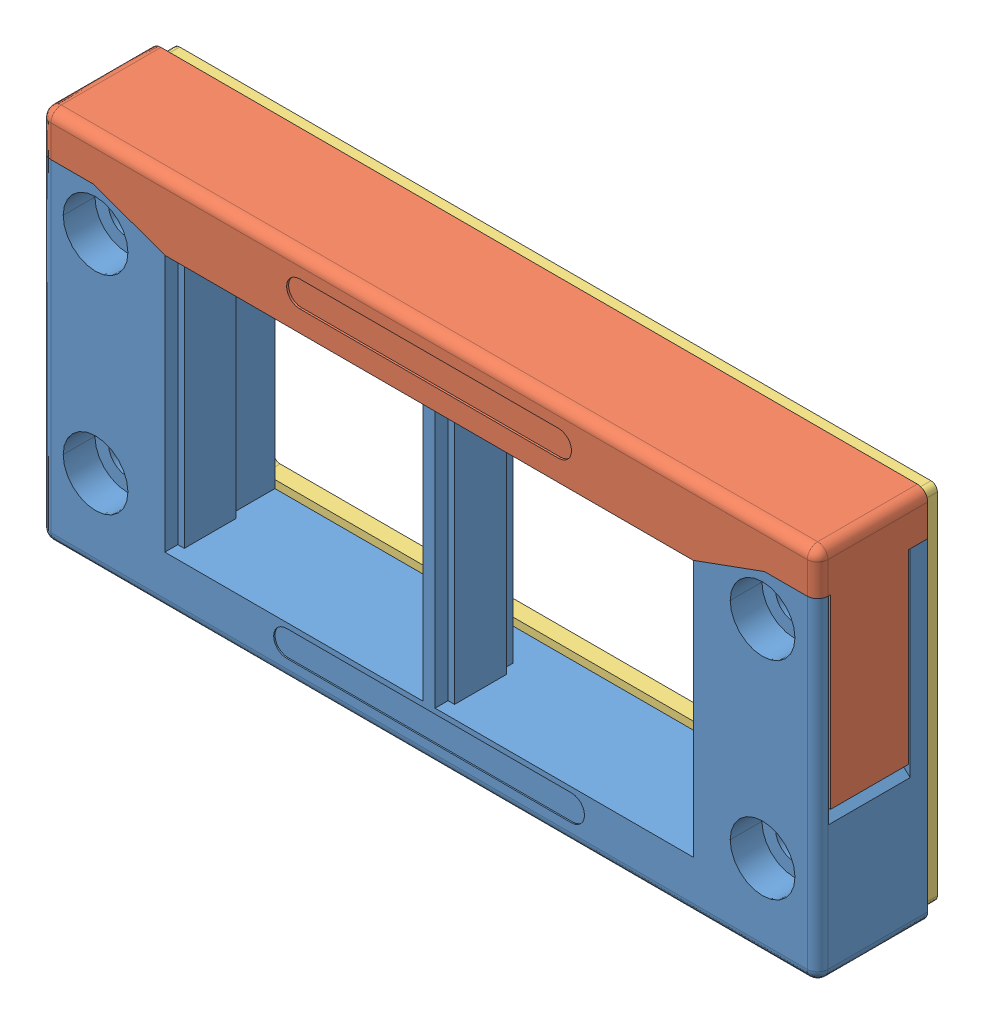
SolidWorks assembly 42426.SLDASM, configuration Default (file format 8000). Lengths in mm.
Overall size (120 58 19.5).
3 component instances, 3 part files, 0 mates.
Components (placement in the parent):
- 42426_01-1: 42426_01.SLDPRT [Default] at origin size (120 51.5 17)
- 42426_02-1: 42426_02.SLDPRT [Default] at origin size (120 35.2 17)
- 42426_03-1: 42426_03.SLDPRT [Default] at origin size (118 56 2.5)
